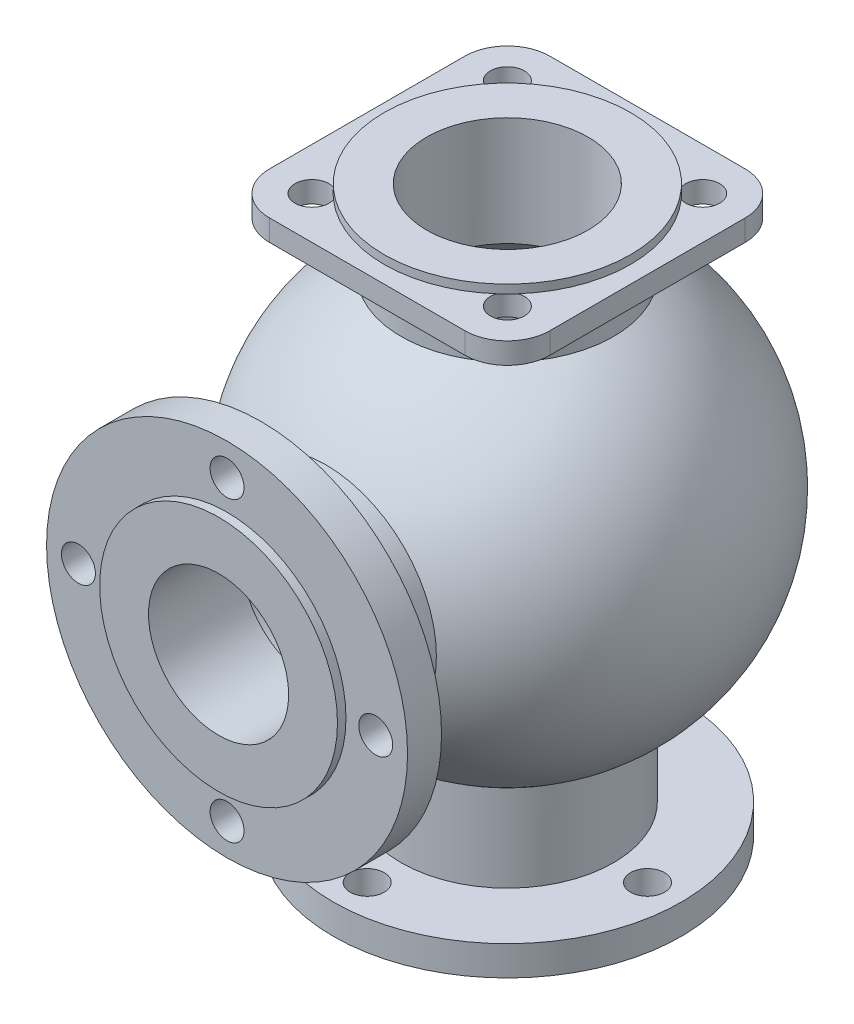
from build123d import *

# Parameters (mm, degrees)
SKETCH2_R                = 29
BOSS_EXTRUDE1_DEPTH      = 2
BOSS_EXTRUDE2_DEPTH      = 5
BOSS_EXTRUDE3_REACH      = 128.59
BOSS_EXTRUDE3_END_RADIUS = 50
SKETCH4_R                = 25
CUT_EXTRUDE1_REACH       = 134.454
CUT_EXTRUDE1_END_RADIUS  = 41
SKETCH5_R                = 19
SKETCH6_R                = 28
BOSS_EXTRUDE4_DEPTH      = 2
SKETCH7_R                = 42.5
BOSS_EXTRUDE5_DEPTH      = 8
BOSS_EXTRUDE6_REACH      = 136.194
BOSS_EXTRUDE6_END_RADIUS = 50
SKETCH8_R                = 26
SKETCH9_R                = 16.5
CUT_EXTRUDE2_DEPTH       = 22
CUT_EXTRUDE3_REACH       = 126.74
CUT_EXTRUDE3_END_RADIUS  = 41
SKETCH10_R               = 18
CUT_EXTRUDE4_REACH       = 142.712
SKETCH11_R               = 4
SKETCH20_R               = 4
CUT_EXTRUDE5_DEPTH       = 10
SKETCH21_R               = 27
BOSS_EXTRUDE7_DEPTH      = 2
SKETCH22_R               = 41
BOSS_EXTRUDE8_DEPTH      = 7
BOSS_EXTRUDE9_REACH      = 153.658
SKETCH23_R               = 25
CUT_EXTRUDE6_REACH       = 159.521
SKETCH24_R               = 4
SKETCH25_R               = 14
CUT_EXTRUDE7_DEPTH       = 19
CUT_EXTRUDE8_REACH       = 145.457
CUT_EXTRUDE8_END_RADIUS  = 41
SKETCH26_R               = 19
SKETCH27_W               = 9.65
SKETCH27_H               = 6
CUT_EXTRUDE9_REACH       = 145.441
CUT_EXTRUDE9_END_RADIUS  = 41
SKETCH28_R               = 3.5


with BuildPart() as part:
    # Sketch1 → Revolve1 (revolve)
    with BuildSketch(Plane(origin=(0, 0, 0), x_dir=(0, 0, -1), z_dir=(1, 0, 0))):
        with BuildLine():
            Line((0, 50), (0, 41))
            ThreePointArc((0, 41), (-41, 0), (0, -41))
            Line((0, -41), (0, -50))
            ThreePointArc((0, -50), (-50, 0), (0, 50))
        make_face()
    revolve(axis=Axis((0, 53.790074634, 0), (0, -1, 0)))



with BuildPart() as body_2:
    # Sketch2 → Boss-Extrude1 (new body)
    with BuildSketch(Plane(origin=(0, 62, 0), x_dir=(1, 0, 0), z_dir=(0, 1, 0))):
        with Locations(Location((0, 0, 0), (0, 0, 270))):
            Circle(SKETCH2_R)
    extrude(amount=-BOSS_EXTRUDE1_DEPTH)

    # Sketch3 → Boss-Extrude2 (add)
    with BuildSketch(Plane.XZ.offset(-60)):
        with BuildLine():
            Line((-23, 33), (23, 33))
            ThreePointArc((23, 33), (30.071067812, 30.071067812), (33, 23))
            Line((33, 23), (33, -23))
            ThreePointArc((33, -23), (30.071067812, -30.071067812), (23, -33))
            Line((23, -33), (-23, -33))
            ThreePointArc((-23, -33), (-30.071067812, -30.071067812), (-33, -23))
            Line((-33, -23), (-33, 23))
            ThreePointArc((-33, 23), (-30.071067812, 30.071067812), (-23, 33))
        make_face()
    extrude(amount=BOSS_EXTRUDE2_DEPTH)


with BuildPart() as part_1:
    add(part.part)

    add(body_2.part)  # Boss-Extrude3 merges body 2
    # Boss-Extrude3: up to this sphere (the profile starts outside it)
    boss_extrude3_end = Location((0, 0, 0)) * Sphere(BOSS_EXTRUDE3_END_RADIUS, mode=Mode.PRIVATE)
    # Sketch4 → Boss-Extrude3 (add, up to the surface)
    with BuildSketch(Plane.XZ.offset(-55), mode=Mode.PRIVATE) as boss_extrude3_sk1:
        with Locations(Location((0, 0, 0), (0, 0, 270))):
            Circle(SKETCH4_R)
    boss_extrude3_tool1 = extrude(boss_extrude3_sk1.sketch, amount=BOSS_EXTRUDE3_REACH, mode=Mode.PRIVATE) - boss_extrude3_end
    add(boss_extrude3_tool1.solids().sort_by_distance((0, 55, 0))[0])

    # Cut-Extrude1: up to this sphere (the profile starts outside it)
    cut_extrude1_end = Location((0, 0, 0)) * Sphere(CUT_EXTRUDE1_END_RADIUS, mode=Mode.PRIVATE)
    # Sketch5 → Cut-Extrude1 (cut, up to the surface)
    with BuildSketch(Plane(origin=(0, 62, 0), x_dir=(1, 0, 0), z_dir=(0, 1, 0)), mode=Mode.PRIVATE) as cut_extrude1_sk1:
        with Locations(Location((0, 0, 0), (0, 0, 270))):
            Circle(SKETCH5_R)
    cut_extrude1_tool1 = extrude(cut_extrude1_sk1.sketch, amount=-CUT_EXTRUDE1_REACH, mode=Mode.PRIVATE) - cut_extrude1_end
    add(cut_extrude1_tool1.solids().sort_by_distance((0, 62, 0))[0], mode=Mode.SUBTRACT)



with BuildPart() as body_2_2:
    # Sketch6 → Boss-Extrude4 (new body)
    with BuildSketch(Plane.XY.offset(68)):
        Circle(SKETCH6_R)
    extrude(amount=-BOSS_EXTRUDE4_DEPTH)

    # Sketch7 → Boss-Extrude5 (add)
    with BuildSketch(Plane(origin=(0, 0, 66), x_dir=(-1, 0, 0), z_dir=(0, 0, -1))):
        Circle(SKETCH7_R)
    extrude(amount=BOSS_EXTRUDE5_DEPTH)


with BuildPart() as part_2:
    add(part_1.part)

    add(body_2_2.part)  # Boss-Extrude6 merges body 2 2
    # Boss-Extrude6: up to this sphere (the profile starts outside it)
    boss_extrude6_end = Location((0, 0, 0)) * Sphere(BOSS_EXTRUDE6_END_RADIUS, mode=Mode.PRIVATE)
    # Sketch8 → Boss-Extrude6 (add, up to the surface)
    with BuildSketch(Plane(origin=(0, 0, 58), x_dir=(-1, 0, 0), z_dir=(0, 0, -1)), mode=Mode.PRIVATE) as boss_extrude6_sk1:
        Circle(SKETCH8_R)
    boss_extrude6_tool1 = extrude(boss_extrude6_sk1.sketch, amount=BOSS_EXTRUDE6_REACH, mode=Mode.PRIVATE) - boss_extrude6_end
    add(boss_extrude6_tool1.solids().sort_by_distance((0, 0, 58))[0])

    # Sketch9 → Cut-Extrude2 (cut)
    with BuildSketch(Plane.XY.offset(68)):
        Circle(SKETCH9_R)
    extrude(amount=-CUT_EXTRUDE2_DEPTH, mode=Mode.SUBTRACT)

    # Cut-Extrude3: up to this sphere (the profile starts outside it)
    cut_extrude3_end = Location((0, 0, 0)) * Sphere(CUT_EXTRUDE3_END_RADIUS, mode=Mode.PRIVATE)
    # Sketch10 → Cut-Extrude3 (cut, up to the surface)
    with BuildSketch(Plane.XY.offset(46), mode=Mode.PRIVATE) as cut_extrude3_sk1:
        Circle(SKETCH10_R)
    cut_extrude3_tool1 = extrude(cut_extrude3_sk1.sketch, amount=-CUT_EXTRUDE3_REACH, mode=Mode.PRIVATE) - cut_extrude3_end
    add(cut_extrude3_tool1.solids().sort_by_distance((0, 0, 46))[0], mode=Mode.SUBTRACT)

    # Sketch11 → Cut-Extrude4 (cut, up to next)
    with BuildSketch(Plane.XY.offset(66), mode=Mode.PRIVATE) as cut_extrude4_sk1:
        with Locations((0, 35)):
            Circle(SKETCH11_R)
    cut_extrude4_tool1 = extrude(cut_extrude4_sk1.sketch, amount=-CUT_EXTRUDE4_REACH, mode=Mode.PRIVATE) & part_2.part
    # Sketch11 → Cut-Extrude4 (cut, up to next)
    with BuildSketch(Plane.XY.offset(66), mode=Mode.PRIVATE) as cut_extrude4_sk2:
        with Locations((35, 0)):
            Circle(SKETCH11_R)
    cut_extrude4_tool2 = extrude(cut_extrude4_sk2.sketch, amount=-CUT_EXTRUDE4_REACH, mode=Mode.PRIVATE) & part_2.part
    # Sketch11 → Cut-Extrude4 (cut, up to next)
    with BuildSketch(Plane.XY.offset(66), mode=Mode.PRIVATE) as cut_extrude4_sk3:
        with Locations((0, -35)):
            Circle(SKETCH11_R)
    cut_extrude4_tool3 = extrude(cut_extrude4_sk3.sketch, amount=-CUT_EXTRUDE4_REACH, mode=Mode.PRIVATE) & part_2.part
    # Sketch11 → Cut-Extrude4 (cut, up to next)
    with BuildSketch(Plane.XY.offset(66), mode=Mode.PRIVATE) as cut_extrude4_sk4:
        with Locations((-35, 0)):
            Circle(SKETCH11_R)
    cut_extrude4_tool4 = extrude(cut_extrude4_sk4.sketch, amount=-CUT_EXTRUDE4_REACH, mode=Mode.PRIVATE) & part_2.part
    add(cut_extrude4_tool1.solids().sort_by_distance((0, 35, 66))[0], mode=Mode.SUBTRACT)
    add(cut_extrude4_tool2.solids().sort_by_distance((35, 0, 66))[0], mode=Mode.SUBTRACT)
    add(cut_extrude4_tool3.solids().sort_by_distance((0, -35, 66))[0], mode=Mode.SUBTRACT)
    add(cut_extrude4_tool4.solids().sort_by_distance((-35, 0, 66))[0], mode=Mode.SUBTRACT)

    # Sketch20 → Cut-Extrude5 (cut)
    with BuildSketch(Plane(origin=(0, 60, 0), x_dir=(1, 0, 0), z_dir=(0, 1, 0))):
        with Locations(Location((-23, 23, 0), (0, 0, 288.561449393))):
            Circle(SKETCH20_R)
        with Locations(Location((23, 23, 0), (0, 0, 251.438550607))):
            Circle(SKETCH20_R)
        with Locations(Location((23, -23, 0), (0, 0, 161.438550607))):
            Circle(SKETCH20_R)
        with Locations(Location((-23, -23, 0), (0, 0, 18.561449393))):
            Circle(SKETCH20_R)
    extrude(amount=-CUT_EXTRUDE5_DEPTH, mode=Mode.SUBTRACT)

    # Sketch23 → Boss-Extrude9 (add, up to next)
    with BuildSketch(Plane(origin=(0, -64, 0), x_dir=(1, 0, 0), z_dir=(0, 1, 0)), mode=Mode.PRIVATE) as boss_extrude9_sk1:
        with Locations(Location((0, 0, 0), (0, 0, 90))):
            Circle(SKETCH23_R)
    boss_extrude9_tool1 = extrude(boss_extrude9_sk1.sketch, amount=BOSS_EXTRUDE9_REACH, mode=Mode.PRIVATE) - part_2.part


with BuildPart() as body_2_3:
    # Sketch21 → Boss-Extrude7 (new body)
    with BuildSketch(Plane(origin=(0, -73, 0), x_dir=(1, 0, 0), z_dir=(0, 1, 0))):
        with Locations(Location((0, 0, 0), (0, 0, 270))):
            Circle(SKETCH21_R)
    extrude(amount=BOSS_EXTRUDE7_DEPTH)

    # Sketch22 → Boss-Extrude8 (add)
    with BuildSketch(Plane(origin=(0, -71, 0), x_dir=(1, 0, 0), z_dir=(0, 1, 0))):
        with Locations(Location((0, 0, 0), (0, 0, 270))):
            Circle(SKETCH22_R)
    extrude(amount=BOSS_EXTRUDE8_DEPTH)


with BuildPart() as part_3:
    add(part_2.part)

    add(body_2_3.part)  # Boss-Extrude9 merges body 2 3
    add(boss_extrude9_tool1.solids().sort_by_distance((0, -64, 0))[0])

    # Sketch24 → Cut-Extrude6 (cut, up to next)
    with BuildSketch(Plane.XZ.offset(71), mode=Mode.PRIVATE) as cut_extrude6_sk1:
        with Locations(Location((0, 33, 0), (0, 0, 270))):
            Circle(SKETCH24_R)
    cut_extrude6_tool1 = extrude(cut_extrude6_sk1.sketch, amount=-CUT_EXTRUDE6_REACH, mode=Mode.PRIVATE) & part_3.part
    # Sketch24 → Cut-Extrude6 (cut, up to next)
    with BuildSketch(Plane.XZ.offset(71), mode=Mode.PRIVATE) as cut_extrude6_sk2:
        with Locations(Location((33, 0, 0), (0, 0, 270))):
            Circle(SKETCH24_R)
    cut_extrude6_tool2 = extrude(cut_extrude6_sk2.sketch, amount=-CUT_EXTRUDE6_REACH, mode=Mode.PRIVATE) & part_3.part
    # Sketch24 → Cut-Extrude6 (cut, up to next)
    with BuildSketch(Plane.XZ.offset(71), mode=Mode.PRIVATE) as cut_extrude6_sk3:
        with Locations(Location((0, -33, 0), (0, 0, 270))):
            Circle(SKETCH24_R)
    cut_extrude6_tool3 = extrude(cut_extrude6_sk3.sketch, amount=-CUT_EXTRUDE6_REACH, mode=Mode.PRIVATE) & part_3.part
    # Sketch24 → Cut-Extrude6 (cut, up to next)
    with BuildSketch(Plane.XZ.offset(71), mode=Mode.PRIVATE) as cut_extrude6_sk4:
        with Locations(Location((-33, 0, 0), (0, 0, 270))):
            Circle(SKETCH24_R)
    cut_extrude6_tool4 = extrude(cut_extrude6_sk4.sketch, amount=-CUT_EXTRUDE6_REACH, mode=Mode.PRIVATE) & part_3.part
    add(cut_extrude6_tool1.solids().sort_by_distance((0, -71, 33))[0], mode=Mode.SUBTRACT)
    add(cut_extrude6_tool2.solids().sort_by_distance((33, -71, 0))[0], mode=Mode.SUBTRACT)
    add(cut_extrude6_tool3.solids().sort_by_distance((0, -71, -33))[0], mode=Mode.SUBTRACT)
    add(cut_extrude6_tool4.solids().sort_by_distance((-33, -71, 0))[0], mode=Mode.SUBTRACT)

    # Sketch25 → Cut-Extrude7 (cut)
    with BuildSketch(Plane.XZ.offset(73)):
        with Locations(Location((0, 0, 0), (0, 0, 270))):
            Circle(SKETCH25_R)
    extrude(amount=-CUT_EXTRUDE7_DEPTH, mode=Mode.SUBTRACT)

    # Cut-Extrude8: up to this sphere (the profile starts outside it)
    cut_extrude8_end = Location((0, 0, 0)) * Sphere(CUT_EXTRUDE8_END_RADIUS, mode=Mode.PRIVATE)
    # Sketch26 → Cut-Extrude8 (cut, up to the surface)
    with BuildSketch(Plane.XZ.offset(54), mode=Mode.PRIVATE) as cut_extrude8_sk1:
        with Locations(Location((0, 0, 0), (0, 0, 90))):
            Circle(SKETCH26_R)
    cut_extrude8_tool1 = extrude(cut_extrude8_sk1.sketch, amount=-CUT_EXTRUDE8_REACH, mode=Mode.PRIVATE) - cut_extrude8_end
    add(cut_extrude8_tool1.solids().sort_by_distance((0, -54, 0))[0], mode=Mode.SUBTRACT)

    # Sketch27 → Revolve2 (revolve)
    with BuildSketch(Plane(origin=(0, 0, 0), x_dir=(0, 0, -1), z_dir=(1, 0, 0)), mode=Mode.PRIVATE) as revolve2_sk:
        with Locations((40.075, -25)):
            Rectangle(SKETCH27_W, SKETCH27_H)
    revolve(revolve2_sk.sketch.rotate(Axis((0, -28, -35.25), (0, 0, -1)), 90), axis=Axis((0, -28, -35.25), (0, 0, -1)))

    # Cut-Extrude9: up to this sphere (the profile starts outside it)
    cut_extrude9_end = Location((0, 0, 0)) * Sphere(CUT_EXTRUDE9_END_RADIUS, mode=Mode.PRIVATE)
    # Sketch28 → Cut-Extrude9 (cut, up to the surface)
    with BuildSketch(Plane(origin=(0, 0, -44.9), x_dir=(-1, 0, 0), z_dir=(0, 0, -1)), mode=Mode.PRIVATE) as cut_extrude9_sk1:
        with Locations((0, -28)):
            Circle(SKETCH28_R)
    cut_extrude9_tool1 = extrude(cut_extrude9_sk1.sketch, amount=-CUT_EXTRUDE9_REACH, mode=Mode.PRIVATE) - cut_extrude9_end
    add(cut_extrude9_tool1.solids().sort_by_distance((0, -28, -44.9))[0], mode=Mode.SUBTRACT)


solid = part_3.part
